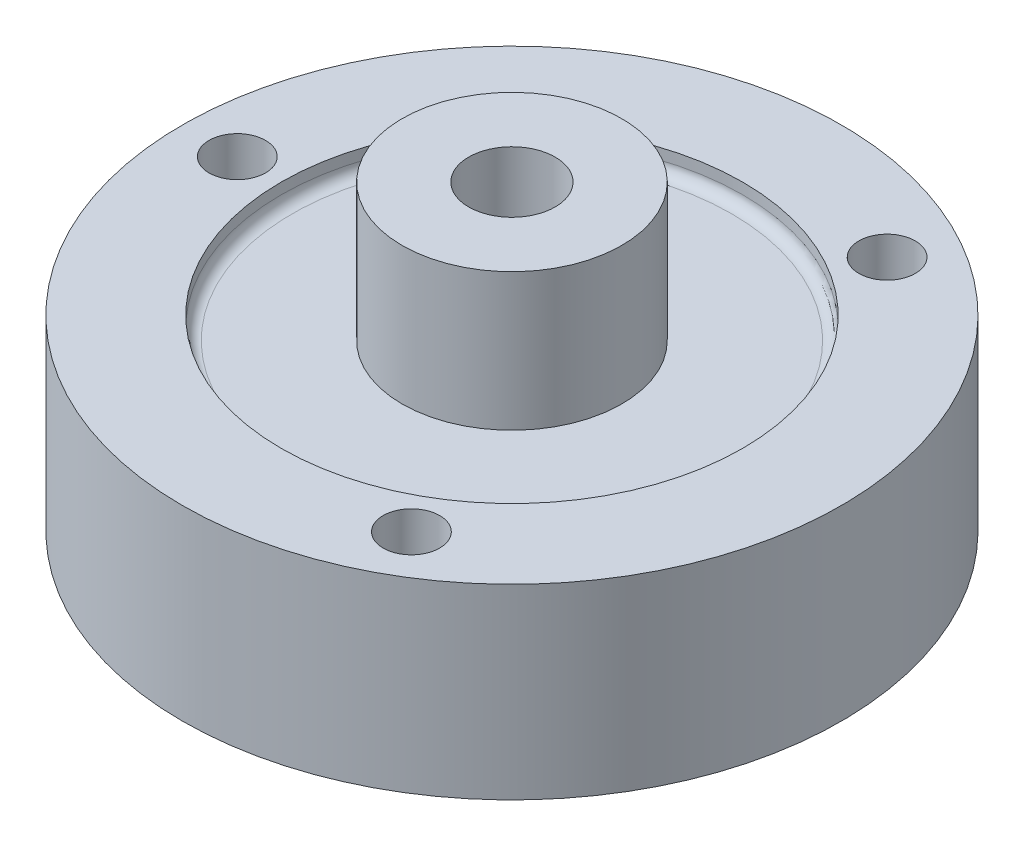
ISO-10303-21;
HEADER;
FILE_DESCRIPTION(('STEP AP214'),'2;1');
FILE_NAME('part.step','',(''),(''),'','','');
FILE_SCHEMA(('AUTOMOTIVE_DESIGN { 1 0 10303 214 1 1 1 1 }'));
ENDSEC;
DATA;
#1=APPLICATION_CONTEXT('core data for automotive mechanical design processes');
#2=APPLICATION_PROTOCOL_DEFINITION('international standard','automotive_design',2000,#1);
#3=PRODUCT_CONTEXT('',#1,'mechanical');
#4=PRODUCT('Part','Part','',(#3));
#5=PRODUCT_RELATED_PRODUCT_CATEGORY('part','',(#4));
#6=PRODUCT_DEFINITION_FORMATION('','',#4);
#7=PRODUCT_DEFINITION_CONTEXT('part definition',#1,'design');
#8=PRODUCT_DEFINITION('design','',#6,#7);
#9=PRODUCT_DEFINITION_SHAPE('','',#8);
#10=(LENGTH_UNIT() NAMED_UNIT(*) SI_UNIT(.MILLI.,.METRE.));
#11=(NAMED_UNIT(*) PLANE_ANGLE_UNIT() SI_UNIT($,.RADIAN.));
#12=(NAMED_UNIT(*) SI_UNIT($,.STERADIAN.) SOLID_ANGLE_UNIT());
#13=UNCERTAINTY_MEASURE_WITH_UNIT(LENGTH_MEASURE(1.E-05),#10,'distance_accuracy_value','');
#14=(GEOMETRIC_REPRESENTATION_CONTEXT(3) GLOBAL_UNCERTAINTY_ASSIGNED_CONTEXT((#13)) GLOBAL_UNIT_ASSIGNED_CONTEXT((#10,
#11,#12)) REPRESENTATION_CONTEXT('',''));
#15=CARTESIAN_POINT('',(0.,0.,0.));
#16=DIRECTION('',(0.,0.,1.));
#17=DIRECTION('',(1.,0.,0.));
#18=AXIS2_PLACEMENT_3D('',#15,#16,#17);
#19=CARTESIAN_POINT('',(0.,10.795,0.));
#20=DIRECTION('',(0.,-1.,0.));
#21=DIRECTION('',(0.,0.,-1.));
#22=AXIS2_PLACEMENT_3D('',#19,#20,#21);
#23=CYLINDRICAL_SURFACE('',#22,19.05);
#24=CARTESIAN_POINT('',(0.,10.795,0.));
#25=DIRECTION('',(0.,1.,0.));
#26=DIRECTION('',(0.,0.,1.));
#27=AXIS2_PLACEMENT_3D('',#24,#25,#26);
#28=CIRCLE('',#27,19.05);
#29=CARTESIAN_POINT('',(0.,10.795,19.05));
#30=VERTEX_POINT('',#29);
#31=EDGE_CURVE('E107',#30,#30,#28,.T.);
#32=ORIENTED_EDGE('',*,*,#31,.F.);
#33=EDGE_LOOP('',(#32));
#34=FACE_BOUND('',#33,.T.);
#35=CARTESIAN_POINT('',(0.,0.,0.));
#36=DIRECTION('',(0.,1.,0.));
#37=DIRECTION('',(0.,0.,1.));
#38=AXIS2_PLACEMENT_3D('',#35,#36,#37);
#39=CIRCLE('',#38,19.05);
#40=CARTESIAN_POINT('',(0.,0.,19.05));
#41=VERTEX_POINT('',#40);
#42=EDGE_CURVE('E106',#41,#41,#39,.T.);
#43=ORIENTED_EDGE('',*,*,#42,.T.);
#44=EDGE_LOOP('',(#43));
#45=FACE_BOUND('',#44,.T.);
#46=ADVANCED_FACE('F45',(#34,#45),#23,.T.);
#47=CARTESIAN_POINT('',(0.,10.795,0.));
#48=DIRECTION('',(0.,1.,0.));
#49=DIRECTION('',(0.,0.,1.));
#50=AXIS2_PLACEMENT_3D('',#47,#48,#49);
#51=PLANE('',#50);
#52=CARTESIAN_POINT('',(7.93749999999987,10.795,-13.748153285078));
#53=DIRECTION('',(0.,1.,0.));
#54=DIRECTION('',(0.,0.,1.));
#55=AXIS2_PLACEMENT_3D('',#52,#53,#54);
#56=CIRCLE('',#55,1.63195);
#57=CARTESIAN_POINT('',(7.93749999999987,10.795,-12.116203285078));
#58=VERTEX_POINT('',#57);
#59=EDGE_CURVE('E83',#58,#58,#56,.T.);
#60=ORIENTED_EDGE('',*,*,#59,.F.);
#61=EDGE_LOOP('',(#60));
#62=FACE_BOUND('',#61,.T.);
#63=CARTESIAN_POINT('',(7.93750000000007,10.795,13.7481532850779));
#64=DIRECTION('',(0.,1.,0.));
#65=DIRECTION('',(0.,0.,1.));
#66=AXIS2_PLACEMENT_3D('',#63,#64,#65);
#67=CIRCLE('',#66,1.63195);
#68=CARTESIAN_POINT('',(7.93750000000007,10.795,15.3801032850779));
#69=VERTEX_POINT('',#68);
#70=EDGE_CURVE('E88',#69,#69,#67,.T.);
#71=ORIENTED_EDGE('',*,*,#70,.F.);
#72=EDGE_LOOP('',(#71));
#73=FACE_BOUND('',#72,.T.);
#74=CARTESIAN_POINT('',(-15.875,10.795,0.));
#75=DIRECTION('',(0.,1.,0.));
#76=DIRECTION('',(0.,0.,1.));
#77=AXIS2_PLACEMENT_3D('',#74,#75,#76);
#78=CIRCLE('',#77,1.63195);
#79=CARTESIAN_POINT('',(-15.875,10.795,1.63195));
#80=VERTEX_POINT('',#79);
#81=EDGE_CURVE('E93',#80,#80,#78,.T.);
#82=ORIENTED_EDGE('',*,*,#81,.F.);
#83=EDGE_LOOP('',(#82));
#84=FACE_BOUND('',#83,.T.);
#85=CARTESIAN_POINT('',(0.,10.795,0.));
#86=DIRECTION('',(0.,1.,0.));
#87=DIRECTION('',(0.,0.,1.));
#88=AXIS2_PLACEMENT_3D('',#85,#86,#87);
#89=CIRCLE('',#88,13.335);
#90=CARTESIAN_POINT('',(0.,10.795,13.335));
#91=VERTEX_POINT('',#90);
#92=EDGE_CURVE('E98',#91,#91,#89,.T.);
#93=ORIENTED_EDGE('',*,*,#92,.F.);
#94=EDGE_LOOP('',(#93));
#95=FACE_BOUND('',#94,.T.);
#96=ORIENTED_EDGE('',*,*,#31,.T.);
#97=EDGE_LOOP('',(#96));
#98=FACE_BOUND('',#97,.T.);
#99=ADVANCED_FACE('F151',(#62,#73,#84,#95,#98),#51,.T.);
#100=CARTESIAN_POINT('',(0.,0.,0.));
#101=DIRECTION('',(0.,1.,0.));
#102=DIRECTION('',(0.,0.,1.));
#103=AXIS2_PLACEMENT_3D('',#100,#101,#102);
#104=PLANE('',#103);
#105=CARTESIAN_POINT('',(7.93749999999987,0.,-13.748153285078));
#106=DIRECTION('',(0.,1.,0.));
#107=DIRECTION('',(0.,0.,1.));
#108=AXIS2_PLACEMENT_3D('',#105,#106,#107);
#109=CIRCLE('',#108,1.63195);
#110=CARTESIAN_POINT('',(7.93749999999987,0.,-12.116203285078));
#111=VERTEX_POINT('',#110);
#112=EDGE_CURVE('E49',#111,#111,#109,.T.);
#113=ORIENTED_EDGE('',*,*,#112,.T.);
#114=EDGE_LOOP('',(#113));
#115=FACE_BOUND('',#114,.T.);
#116=CARTESIAN_POINT('',(7.93750000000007,0.,13.7481532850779));
#117=DIRECTION('',(0.,1.,0.));
#118=DIRECTION('',(0.,0.,1.));
#119=AXIS2_PLACEMENT_3D('',#116,#117,#118);
#120=CIRCLE('',#119,1.63195);
#121=CARTESIAN_POINT('',(7.93750000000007,0.,15.3801032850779));
#122=VERTEX_POINT('',#121);
#123=EDGE_CURVE('E92',#122,#122,#120,.T.);
#124=ORIENTED_EDGE('',*,*,#123,.T.);
#125=EDGE_LOOP('',(#124));
#126=FACE_BOUND('',#125,.T.);
#127=CARTESIAN_POINT('',(-15.875,0.,0.));
#128=DIRECTION('',(0.,1.,0.));
#129=DIRECTION('',(0.,0.,1.));
#130=AXIS2_PLACEMENT_3D('',#127,#128,#129);
#131=CIRCLE('',#130,1.63195);
#132=CARTESIAN_POINT('',(-15.875,0.,1.63195));
#133=VERTEX_POINT('',#132);
#134=EDGE_CURVE('E97',#133,#133,#131,.T.);
#135=ORIENTED_EDGE('',*,*,#134,.T.);
#136=EDGE_LOOP('',(#135));
#137=FACE_BOUND('',#136,.T.);
#138=CARTESIAN_POINT('',(0.,0.,0.));
#139=DIRECTION('',(0.,1.,0.));
#140=DIRECTION('',(0.,0.,1.));
#141=AXIS2_PLACEMENT_3D('',#138,#139,#140);
#142=CIRCLE('',#141,6.35);
#143=CARTESIAN_POINT('',(0.,0.,6.35));
#144=VERTEX_POINT('',#143);
#145=EDGE_CURVE('E11',#144,#144,#142,.T.);
#146=ORIENTED_EDGE('',*,*,#145,.T.);
#147=EDGE_LOOP('',(#146));
#148=FACE_BOUND('',#147,.T.);
#149=ORIENTED_EDGE('',*,*,#42,.F.);
#150=EDGE_LOOP('',(#149));
#151=FACE_BOUND('',#150,.T.);
#152=ADVANCED_FACE('F132',(#115,#126,#137,#148,#151),#104,.F.);
#153=CARTESIAN_POINT('',(0.,-2.54,0.));
#154=DIRECTION('',(0.,1.,0.));
#155=DIRECTION('',(0.,0.,1.));
#156=AXIS2_PLACEMENT_3D('',#153,#154,#155);
#157=CYLINDRICAL_SURFACE('',#156,5.715);
#158=CARTESIAN_POINT('',(0.,-0.635,0.));
#159=DIRECTION('',(0.,1.,0.));
#160=DIRECTION('',(0.,0.,1.));
#161=AXIS2_PLACEMENT_3D('',#158,#159,#160);
#162=CIRCLE('',#161,5.715);
#163=CARTESIAN_POINT('',(0.,-0.635,5.715));
#164=VERTEX_POINT('',#163);
#165=EDGE_CURVE('E54',#164,#164,#162,.F.);
#166=ORIENTED_EDGE('',*,*,#165,.T.);
#167=EDGE_LOOP('',(#166));
#168=FACE_BOUND('',#167,.T.);
#169=CARTESIAN_POINT('',(0.,-2.54,0.));
#170=DIRECTION('',(0.,-1.,0.));
#171=DIRECTION('',(0.,0.,-1.));
#172=AXIS2_PLACEMENT_3D('',#169,#170,#171);
#173=CIRCLE('',#172,5.715);
#174=CARTESIAN_POINT('',(0.,-2.54,-5.715));
#175=VERTEX_POINT('',#174);
#176=EDGE_CURVE('E102',#175,#175,#173,.T.);
#177=ORIENTED_EDGE('',*,*,#176,.F.);
#178=EDGE_LOOP('',(#177));
#179=FACE_BOUND('',#178,.T.);
#180=ADVANCED_FACE('F189',(#168,#179),#157,.T.);
#181=CARTESIAN_POINT('',(0.,-2.54,0.));
#182=DIRECTION('',(0.,-1.,0.));
#183=DIRECTION('',(0.,0.,-1.));
#184=AXIS2_PLACEMENT_3D('',#181,#182,#183);
#185=PLANE('',#184);
#186=ORIENTED_EDGE('',*,*,#176,.T.);
#187=EDGE_LOOP('',(#186));
#188=FACE_BOUND('',#187,.T.);
#189=ADVANCED_FACE('F181',(#188),#185,.T.);
#190=CARTESIAN_POINT('',(0.,9.525,0.));
#191=DIRECTION('',(0.,1.,0.));
#192=DIRECTION('',(0.,0.,1.));
#193=AXIS2_PLACEMENT_3D('',#190,#191,#192);
#194=CYLINDRICAL_SURFACE('',#193,13.335);
#195=CARTESIAN_POINT('',(0.,10.16,0.));
#196=DIRECTION('',(0.,1.,0.));
#197=DIRECTION('',(0.,0.,1.));
#198=AXIS2_PLACEMENT_3D('',#195,#196,#197);
#199=CIRCLE('',#198,13.335);
#200=CARTESIAN_POINT('',(0.,10.16,13.335));
#201=VERTEX_POINT('',#200);
#202=EDGE_CURVE('E118',#201,#201,#199,.F.);
#203=ORIENTED_EDGE('',*,*,#202,.T.);
#204=EDGE_LOOP('',(#203));
#205=FACE_BOUND('',#204,.T.);
#206=ORIENTED_EDGE('',*,*,#92,.T.);
#207=EDGE_LOOP('',(#206));
#208=FACE_BOUND('',#207,.T.);
#209=ADVANCED_FACE('F171',(#205,#208),#194,.F.);
#210=CARTESIAN_POINT('',(0.,9.525,0.));
#211=DIRECTION('',(0.,1.,0.));
#212=DIRECTION('',(0.,0.,1.));
#213=AXIS2_PLACEMENT_3D('',#210,#211,#212);
#214=PLANE('',#213);
#215=CARTESIAN_POINT('',(0.,9.525,0.));
#216=DIRECTION('',(0.,1.,0.));
#217=DIRECTION('',(0.,0.,1.));
#218=AXIS2_PLACEMENT_3D('',#215,#216,#217);
#219=CIRCLE('',#218,6.35);
#220=CARTESIAN_POINT('',(0.,9.525,6.35));
#221=VERTEX_POINT('',#220);
#222=EDGE_CURVE('E69',#221,#221,#219,.T.);
#223=ORIENTED_EDGE('',*,*,#222,.F.);
#224=EDGE_LOOP('',(#223));
#225=FACE_BOUND('',#224,.T.);
#226=CARTESIAN_POINT('',(0.,9.525,0.));
#227=DIRECTION('',(0.,1.,0.));
#228=DIRECTION('',(0.,0.,1.));
#229=AXIS2_PLACEMENT_3D('',#226,#227,#228);
#230=CIRCLE('',#229,12.7);
#231=CARTESIAN_POINT('',(0.,9.525,12.7));
#232=VERTEX_POINT('',#231);
#233=EDGE_CURVE('E111',#232,#232,#230,.T.);
#234=ORIENTED_EDGE('',*,*,#233,.T.);
#235=EDGE_LOOP('',(#234));
#236=FACE_BOUND('',#235,.T.);
#237=ADVANCED_FACE('F164',(#225,#236),#214,.T.);
#238=CARTESIAN_POINT('',(0.,10.16,0.));
#239=DIRECTION('',(0.,1.,0.));
#240=DIRECTION('',(0.,0.,1.));
#241=AXIS2_PLACEMENT_3D('',#238,#239,#240);
#242=TOROIDAL_SURFACE('',#241,12.7,0.635);
#243=ORIENTED_EDGE('',*,*,#202,.F.);
#244=EDGE_LOOP('',(#243));
#245=FACE_BOUND('',#244,.T.);
#246=ORIENTED_EDGE('',*,*,#233,.F.);
#247=EDGE_LOOP('',(#246));
#248=FACE_BOUND('',#247,.T.);
#249=ADVANCED_FACE('F162',(#245,#248),#242,.F.);
#250=CARTESIAN_POINT('',(0.,-0.635,0.));
#251=DIRECTION('',(0.,1.,0.));
#252=DIRECTION('',(0.,0.,1.));
#253=AXIS2_PLACEMENT_3D('',#250,#251,#252);
#254=TOROIDAL_SURFACE('',#253,6.35,0.635);
#255=ORIENTED_EDGE('',*,*,#145,.F.);
#256=EDGE_LOOP('',(#255));
#257=FACE_BOUND('',#256,.T.);
#258=ORIENTED_EDGE('',*,*,#165,.F.);
#259=EDGE_LOOP('',(#258));
#260=FACE_BOUND('',#259,.T.);
#261=ADVANCED_FACE('F47',(#257,#260),#254,.F.);
#262=CARTESIAN_POINT('',(-15.875,10.795,0.));
#263=DIRECTION('',(0.,1.,0.));
#264=DIRECTION('',(0.,0.,1.));
#265=AXIS2_PLACEMENT_3D('',#262,#263,#264);
#266=CYLINDRICAL_SURFACE('',#265,1.63195);
#267=ORIENTED_EDGE('',*,*,#81,.T.);
#268=EDGE_LOOP('',(#267));
#269=FACE_BOUND('',#268,.T.);
#270=ORIENTED_EDGE('',*,*,#134,.F.);
#271=EDGE_LOOP('',(#270));
#272=FACE_BOUND('',#271,.T.);
#273=ADVANCED_FACE('F138',(#269,#272),#266,.F.);
#274=CARTESIAN_POINT('',(7.93750000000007,10.795,13.7481532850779));
#275=DIRECTION('',(0.,1.,0.));
#276=DIRECTION('',(0.,0.,1.));
#277=AXIS2_PLACEMENT_3D('',#274,#275,#276);
#278=CYLINDRICAL_SURFACE('',#277,1.63195);
#279=ORIENTED_EDGE('',*,*,#70,.T.);
#280=EDGE_LOOP('',(#279));
#281=FACE_BOUND('',#280,.T.);
#282=ORIENTED_EDGE('',*,*,#123,.F.);
#283=EDGE_LOOP('',(#282));
#284=FACE_BOUND('',#283,.T.);
#285=ADVANCED_FACE('F135',(#281,#284),#278,.F.);
#286=CARTESIAN_POINT('',(7.93749999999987,10.795,-13.748153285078));
#287=DIRECTION('',(0.,1.,0.));
#288=DIRECTION('',(0.,0.,1.));
#289=AXIS2_PLACEMENT_3D('',#286,#287,#288);
#290=CYLINDRICAL_SURFACE('',#289,1.63195);
#291=ORIENTED_EDGE('',*,*,#59,.T.);
#292=EDGE_LOOP('',(#291));
#293=FACE_BOUND('',#292,.T.);
#294=ORIENTED_EDGE('',*,*,#112,.F.);
#295=EDGE_LOOP('',(#294));
#296=FACE_BOUND('',#295,.T.);
#297=ADVANCED_FACE('F137',(#293,#296),#290,.F.);
#298=CARTESIAN_POINT('',(0.,17.4625,0.));
#299=DIRECTION('',(0.,-1.,0.));
#300=DIRECTION('',(0.,0.,-1.));
#301=AXIS2_PLACEMENT_3D('',#298,#299,#300);
#302=CYLINDRICAL_SURFACE('',#301,6.35);
#303=CARTESIAN_POINT('',(0.,17.4625,0.));
#304=DIRECTION('',(0.,1.,0.));
#305=DIRECTION('',(0.,0.,1.));
#306=AXIS2_PLACEMENT_3D('',#303,#304,#305);
#307=CIRCLE('',#306,6.35);
#308=CARTESIAN_POINT('',(0.,17.4625,6.35));
#309=VERTEX_POINT('',#308);
#310=EDGE_CURVE('E76',#309,#309,#307,.T.);
#311=ORIENTED_EDGE('',*,*,#310,.F.);
#312=EDGE_LOOP('',(#311));
#313=FACE_BOUND('',#312,.T.);
#314=ORIENTED_EDGE('',*,*,#222,.T.);
#315=EDGE_LOOP('',(#314));
#316=FACE_BOUND('',#315,.T.);
#317=ADVANCED_FACE('F145',(#313,#316),#302,.T.);
#318=CARTESIAN_POINT('',(0.,17.4625,0.));
#319=DIRECTION('',(0.,1.,0.));
#320=DIRECTION('',(0.,0.,1.));
#321=AXIS2_PLACEMENT_3D('',#318,#319,#320);
#322=PLANE('',#321);
#323=CARTESIAN_POINT('',(0.,17.4625,0.));
#324=DIRECTION('',(0.,1.,0.));
#325=DIRECTION('',(0.,0.,1.));
#326=AXIS2_PLACEMENT_3D('',#323,#324,#325);
#327=CIRCLE('',#326,2.49999999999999);
#328=CARTESIAN_POINT('',(0.,17.4625,2.49999999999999));
#329=VERTEX_POINT('',#328);
#330=EDGE_CURVE('E70',#329,#329,#327,.T.);
#331=ORIENTED_EDGE('',*,*,#330,.F.);
#332=EDGE_LOOP('',(#331));
#333=FACE_BOUND('',#332,.T.);
#334=ORIENTED_EDGE('',*,*,#310,.T.);
#335=EDGE_LOOP('',(#334));
#336=FACE_BOUND('',#335,.T.);
#337=ADVANCED_FACE('F62',(#333,#336),#322,.T.);
#338=CARTESIAN_POINT('',(0.,2.4625046,0.));
#339=DIRECTION('',(0.,1.,0.));
#340=DIRECTION('',(0.,0.,1.));
#341=AXIS2_PLACEMENT_3D('',#338,#339,#340);
#342=CONICAL_SURFACE('',#341,2.5,1.02974425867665);
#343=CARTESIAN_POINT('',(0.,0.960353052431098,0.));
#344=VERTEX_POINT('',#343);
#345=VERTEX_LOOP('',#344);
#346=FACE_BOUND('',#345,.T.);
#347=CARTESIAN_POINT('',(0.,2.4625046,0.));
#348=DIRECTION('',(0.,1.,0.));
#349=DIRECTION('',(0.,0.,1.));
#350=AXIS2_PLACEMENT_3D('',#347,#348,#349);
#351=CIRCLE('',#350,2.5);
#352=CARTESIAN_POINT('',(0.,2.4625046,2.5));
#353=VERTEX_POINT('',#352);
#354=EDGE_CURVE('E66',#353,#353,#351,.T.);
#355=ORIENTED_EDGE('',*,*,#354,.T.);
#356=EDGE_LOOP('',(#355));
#357=FACE_BOUND('',#356,.T.);
#358=ADVANCED_FACE('F58',(#346,#357),#342,.F.);
#359=CARTESIAN_POINT('',(0.,17.4625,0.));
#360=DIRECTION('',(0.,1.,0.));
#361=DIRECTION('',(0.,0.,1.));
#362=AXIS2_PLACEMENT_3D('',#359,#360,#361);
#363=CYLINDRICAL_SURFACE('',#362,2.49999999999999);
#364=ORIENTED_EDGE('',*,*,#354,.F.);
#365=EDGE_LOOP('',(#364));
#366=FACE_BOUND('',#365,.T.);
#367=ORIENTED_EDGE('',*,*,#330,.T.);
#368=EDGE_LOOP('',(#367));
#369=FACE_BOUND('',#368,.T.);
#370=ADVANCED_FACE('F61',(#366,#369),#363,.F.);
#371=CLOSED_SHELL('',(#46,#99,#152,#180,#189,#209,#237,#249,#261,#273,#285,#297,#317,#337,#358,#370));
#372=MANIFOLD_SOLID_BREP('B2',#371);
#373=ADVANCED_BREP_SHAPE_REPRESENTATION('',(#18,#372),#14);
#374=SHAPE_DEFINITION_REPRESENTATION(#9,#373);
ENDSEC;
END-ISO-10303-21;
